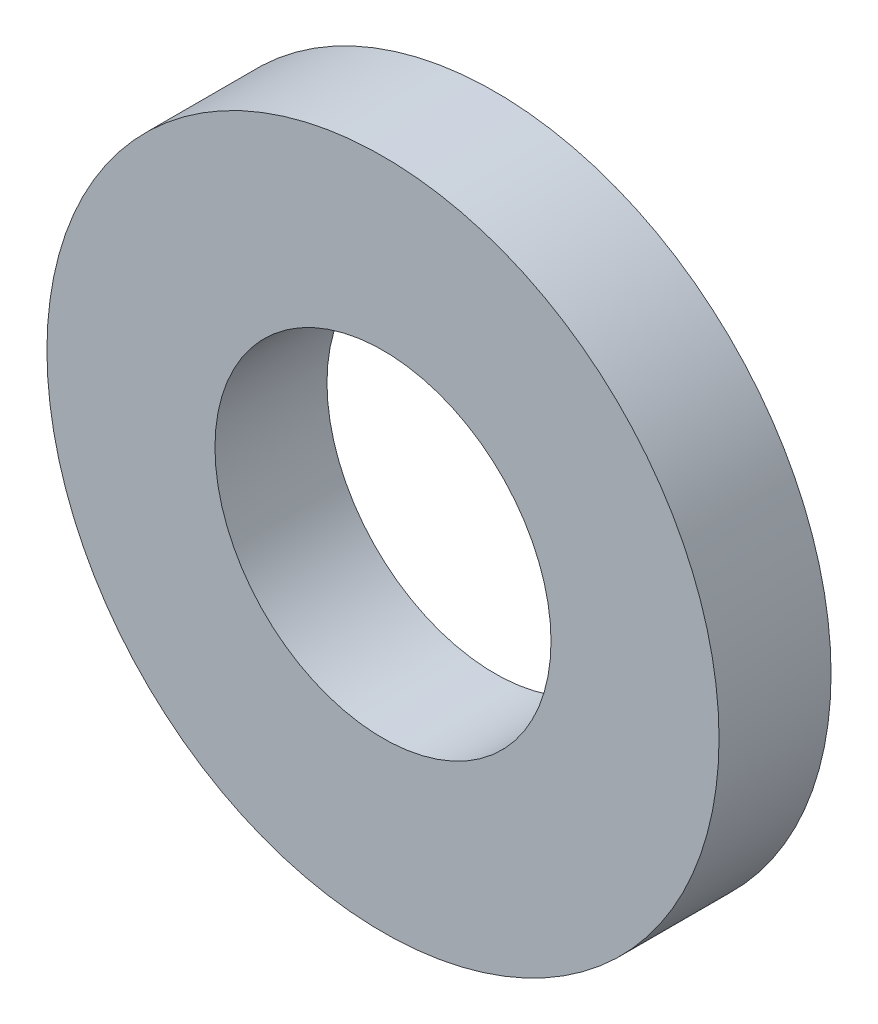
from build123d import *

# Parameters (mm, degrees)
SKETCH1_R                       = 9.525
SKETCH1_R_2                     = 4.7625
F_5906K533_75_OD_X_375_ID_DEPTH = 3.175


with BuildPart() as part:
    # Sketch1 → 5906K533 .75_ od x .375 id (new body)
    with BuildSketch(Plane.XY):
        Circle(SKETCH1_R)
        Circle(SKETCH1_R_2, mode=Mode.SUBTRACT)
    extrude(amount=-F_5906K533_75_OD_X_375_ID_DEPTH)


solid = part.part
